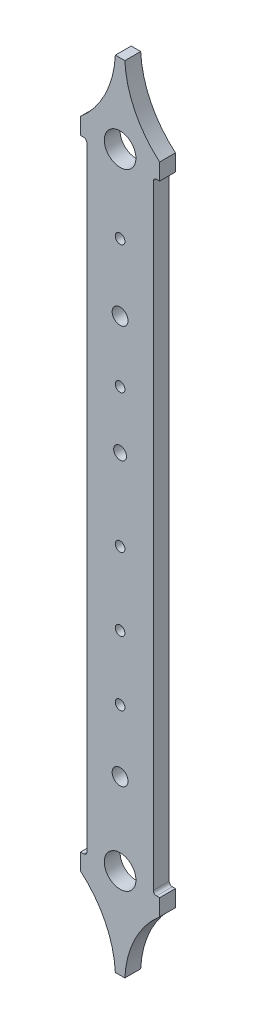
ISO-10303-21;
HEADER;
FILE_DESCRIPTION(('STEP AP214'),'2;1');
FILE_NAME('part.step','',(''),(''),'','','');
FILE_SCHEMA(('AUTOMOTIVE_DESIGN { 1 0 10303 214 1 1 1 1 }'));
ENDSEC;
DATA;
#1=APPLICATION_CONTEXT('core data for automotive mechanical design processes');
#2=APPLICATION_PROTOCOL_DEFINITION('international standard','automotive_design',2000,#1);
#3=PRODUCT_CONTEXT('',#1,'mechanical');
#4=PRODUCT('Part','Part','',(#3));
#5=PRODUCT_RELATED_PRODUCT_CATEGORY('part','',(#4));
#6=PRODUCT_DEFINITION_FORMATION('','',#4);
#7=PRODUCT_DEFINITION_CONTEXT('part definition',#1,'design');
#8=PRODUCT_DEFINITION('design','',#6,#7);
#9=PRODUCT_DEFINITION_SHAPE('','',#8);
#10=(LENGTH_UNIT() NAMED_UNIT(*) SI_UNIT(.MILLI.,.METRE.));
#11=(NAMED_UNIT(*) PLANE_ANGLE_UNIT() SI_UNIT($,.RADIAN.));
#12=(NAMED_UNIT(*) SI_UNIT($,.STERADIAN.) SOLID_ANGLE_UNIT());
#13=UNCERTAINTY_MEASURE_WITH_UNIT(LENGTH_MEASURE(1.E-05),#10,'distance_accuracy_value','');
#14=(GEOMETRIC_REPRESENTATION_CONTEXT(3) GLOBAL_UNCERTAINTY_ASSIGNED_CONTEXT((#13)) GLOBAL_UNIT_ASSIGNED_CONTEXT((#10,
#11,#12)) REPRESENTATION_CONTEXT('',''));
#15=CARTESIAN_POINT('',(0.,0.,0.));
#16=DIRECTION('',(0.,0.,1.));
#17=DIRECTION('',(1.,0.,0.));
#18=AXIS2_PLACEMENT_3D('',#15,#16,#17);
#19=CARTESIAN_POINT('',(20.9999999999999,-196.063687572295,10.));
#20=DIRECTION('',(-1.,0.,0.));
#21=DIRECTION('',(0.,-1.,0.));
#22=AXIS2_PLACEMENT_3D('',#19,#20,#21);
#23=PLANE('',#22);
#24=DIRECTION('',(0.,1.,0.));
#25=VECTOR('',#24,1.);
#26=CARTESIAN_POINT('',(20.9999999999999,-196.063687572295,10.));
#27=LINE('',#26,#25);
#28=CARTESIAN_POINT('',(20.9999999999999,-194.063687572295,10.));
#29=VERTEX_POINT('',#28);
#30=CARTESIAN_POINT('',(21.,194.063687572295,10.));
#31=VERTEX_POINT('',#30);
#32=EDGE_CURVE('E175',#29,#31,#27,.T.);
#33=ORIENTED_EDGE('',*,*,#32,.F.);
#34=DIRECTION('',(0.,0.,-1.));
#35=VECTOR('',#34,1.);
#36=CARTESIAN_POINT('',(20.9999999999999,-194.063687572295,0.));
#37=LINE('',#36,#35);
#38=CARTESIAN_POINT('',(20.9999999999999,-194.063687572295,0.));
#39=VERTEX_POINT('',#38);
#40=EDGE_CURVE('E289',#29,#39,#37,.T.);
#41=ORIENTED_EDGE('',*,*,#40,.T.);
#42=DIRECTION('',(0.,1.,0.));
#43=VECTOR('',#42,1.);
#44=CARTESIAN_POINT('',(20.9999999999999,-196.063687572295,0.));
#45=LINE('',#44,#43);
#46=CARTESIAN_POINT('',(21.,194.063687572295,0.));
#47=VERTEX_POINT('',#46);
#48=EDGE_CURVE('E222',#39,#47,#45,.T.);
#49=ORIENTED_EDGE('',*,*,#48,.T.);
#50=DIRECTION('',(0.,0.,-1.));
#51=VECTOR('',#50,1.);
#52=CARTESIAN_POINT('',(21.,194.063687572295,10.));
#53=LINE('',#52,#51);
#54=EDGE_CURVE('E184',#47,#31,#53,.F.);
#55=ORIENTED_EDGE('',*,*,#54,.T.);
#56=EDGE_LOOP('',(#33,#41,#49,#55));
#57=FACE_BOUND('',#56,.T.);
#58=ADVANCED_FACE('F32',(#57),#23,.F.);
#59=CARTESIAN_POINT('',(25.,196.063687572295,10.));
#60=DIRECTION('',(0.,1.,0.));
#61=DIRECTION('',(-1.,0.,0.));
#62=AXIS2_PLACEMENT_3D('',#59,#60,#61);
#63=PLANE('',#62);
#64=DIRECTION('',(1.,0.,0.));
#65=VECTOR('',#64,1.);
#66=CARTESIAN_POINT('',(25.,196.063687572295,10.));
#67=LINE('',#66,#65);
#68=CARTESIAN_POINT('',(23.,196.063687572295,10.));
#69=VERTEX_POINT('',#68);
#70=CARTESIAN_POINT('',(25.,196.063687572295,10.));
#71=VERTEX_POINT('',#70);
#72=EDGE_CURVE('E167',#69,#71,#67,.T.);
#73=ORIENTED_EDGE('',*,*,#72,.F.);
#74=DIRECTION('',(0.,0.,-1.));
#75=VECTOR('',#74,1.);
#76=CARTESIAN_POINT('',(23.,196.063687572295,0.));
#77=LINE('',#76,#75);
#78=CARTESIAN_POINT('',(23.,196.063687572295,0.));
#79=VERTEX_POINT('',#78);
#80=EDGE_CURVE('E304',#69,#79,#77,.T.);
#81=ORIENTED_EDGE('',*,*,#80,.T.);
#82=DIRECTION('',(1.,0.,0.));
#83=VECTOR('',#82,1.);
#84=CARTESIAN_POINT('',(25.,196.063687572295,0.));
#85=LINE('',#84,#83);
#86=CARTESIAN_POINT('',(25.,196.063687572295,0.));
#87=VERTEX_POINT('',#86);
#88=EDGE_CURVE('E181',#79,#87,#85,.T.);
#89=ORIENTED_EDGE('',*,*,#88,.T.);
#90=DIRECTION('',(0.,0.,-1.));
#91=VECTOR('',#90,1.);
#92=CARTESIAN_POINT('',(25.,196.063687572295,10.));
#93=LINE('',#92,#91);
#94=EDGE_CURVE('E178',#71,#87,#93,.T.);
#95=ORIENTED_EDGE('',*,*,#94,.F.);
#96=EDGE_LOOP('',(#73,#81,#89,#95));
#97=FACE_BOUND('',#96,.T.);
#98=ADVANCED_FACE('F179',(#97),#63,.F.);
#99=CARTESIAN_POINT('',(25.,196.063687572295,10.));
#100=DIRECTION('',(-1.,0.,0.));
#101=DIRECTION('',(0.,0.,1.));
#102=AXIS2_PLACEMENT_3D('',#99,#100,#101);
#103=PLANE('',#102);
#104=DIRECTION('',(0.,1.,0.));
#105=VECTOR('',#104,1.);
#106=CARTESIAN_POINT('',(25.,196.063687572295,0.));
#107=LINE('',#106,#105);
#108=CARTESIAN_POINT('',(25.,206.533687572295,0.));
#109=VERTEX_POINT('',#108);
#110=EDGE_CURVE('E227',#87,#109,#107,.T.);
#111=ORIENTED_EDGE('',*,*,#110,.T.);
#112=DIRECTION('',(0.,0.,-1.));
#113=VECTOR('',#112,1.);
#114=CARTESIAN_POINT('',(25.,206.533687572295,10.));
#115=LINE('',#114,#113);
#116=CARTESIAN_POINT('',(25.,206.533687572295,10.));
#117=VERTEX_POINT('',#116);
#118=EDGE_CURVE('E185',#117,#109,#115,.T.);
#119=ORIENTED_EDGE('',*,*,#118,.F.);
#120=DIRECTION('',(0.,1.,0.));
#121=VECTOR('',#120,1.);
#122=CARTESIAN_POINT('',(25.,196.063687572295,10.));
#123=LINE('',#122,#121);
#124=EDGE_CURVE('E172',#71,#117,#123,.T.);
#125=ORIENTED_EDGE('',*,*,#124,.F.);
#126=ORIENTED_EDGE('',*,*,#94,.T.);
#127=EDGE_LOOP('',(#111,#119,#125,#126));
#128=FACE_BOUND('',#127,.T.);
#129=ADVANCED_FACE('F187',(#128),#103,.F.);
#130=CARTESIAN_POINT('',(65.4177134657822,254.206095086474,10.));
#131=DIRECTION('',(0.,0.,-1.));
#132=DIRECTION('',(-1.,0.,0.));
#133=AXIS2_PLACEMENT_3D('',#130,#131,#132);
#134=CYLINDRICAL_SURFACE('',#133,62.5);
#135=CARTESIAN_POINT('',(65.4177134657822,254.206095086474,0.));
#136=DIRECTION('',(0.,0.,-1.));
#137=DIRECTION('',(1.,0.,0.));
#138=AXIS2_PLACEMENT_3D('',#135,#136,#137);
#139=CIRCLE('',#138,62.5);
#140=CARTESIAN_POINT('',(2.99999999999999,251.,0.));
#141=VERTEX_POINT('',#140);
#142=EDGE_CURVE('E229',#109,#141,#139,.T.);
#143=ORIENTED_EDGE('',*,*,#142,.T.);
#144=DIRECTION('',(0.,0.,-1.));
#145=VECTOR('',#144,1.);
#146=CARTESIAN_POINT('',(2.99999999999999,251.,10.));
#147=LINE('',#146,#145);
#148=CARTESIAN_POINT('',(2.99999999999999,251.,10.));
#149=VERTEX_POINT('',#148);
#150=EDGE_CURVE('E284',#149,#141,#147,.T.);
#151=ORIENTED_EDGE('',*,*,#150,.F.);
#152=CARTESIAN_POINT('',(65.4177134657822,254.206095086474,10.));
#153=DIRECTION('',(0.,0.,-1.));
#154=DIRECTION('',(1.,0.,0.));
#155=AXIS2_PLACEMENT_3D('',#152,#153,#154);
#156=CIRCLE('',#155,62.5);
#157=EDGE_CURVE('E190',#117,#149,#156,.T.);
#158=ORIENTED_EDGE('',*,*,#157,.F.);
#159=ORIENTED_EDGE('',*,*,#118,.T.);
#160=EDGE_LOOP('',(#143,#151,#158,#159));
#161=FACE_BOUND('',#160,.T.);
#162=ADVANCED_FACE('F387',(#161),#134,.F.);
#163=CARTESIAN_POINT('',(2.99999999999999,251.,10.));
#164=DIRECTION('',(0.,-1.,0.));
#165=DIRECTION('',(0.,0.,-1.));
#166=AXIS2_PLACEMENT_3D('',#163,#164,#165);
#167=PLANE('',#166);
#168=DIRECTION('',(-1.,0.,0.));
#169=VECTOR('',#168,1.);
#170=CARTESIAN_POINT('',(2.99999999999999,251.,0.));
#171=LINE('',#170,#169);
#172=CARTESIAN_POINT('',(-3.00000000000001,251.,0.));
#173=VERTEX_POINT('',#172);
#174=EDGE_CURVE('E231',#141,#173,#171,.T.);
#175=ORIENTED_EDGE('',*,*,#174,.T.);
#176=DIRECTION('',(0.,0.,-1.));
#177=VECTOR('',#176,1.);
#178=CARTESIAN_POINT('',(-3.00000000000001,251.,10.));
#179=LINE('',#178,#177);
#180=CARTESIAN_POINT('',(-3.00000000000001,251.,10.));
#181=VERTEX_POINT('',#180);
#182=EDGE_CURVE('E281',#181,#173,#179,.T.);
#183=ORIENTED_EDGE('',*,*,#182,.F.);
#184=DIRECTION('',(-1.,0.,0.));
#185=VECTOR('',#184,1.);
#186=CARTESIAN_POINT('',(2.99999999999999,251.,10.));
#187=LINE('',#186,#185);
#188=EDGE_CURVE('E192',#149,#181,#187,.T.);
#189=ORIENTED_EDGE('',*,*,#188,.F.);
#190=ORIENTED_EDGE('',*,*,#150,.T.);
#191=EDGE_LOOP('',(#175,#183,#189,#190));
#192=FACE_BOUND('',#191,.T.);
#193=ADVANCED_FACE('F394',(#192),#167,.F.);
#194=CARTESIAN_POINT('',(-65.4177134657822,254.206095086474,10.));
#195=DIRECTION('',(0.,0.,-1.));
#196=DIRECTION('',(-1.,0.,0.));
#197=AXIS2_PLACEMENT_3D('',#194,#195,#196);
#198=CYLINDRICAL_SURFACE('',#197,62.5);
#199=CARTESIAN_POINT('',(-65.4177134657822,254.206095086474,0.));
#200=DIRECTION('',(0.,0.,-1.));
#201=DIRECTION('',(-1.,0.,0.));
#202=AXIS2_PLACEMENT_3D('',#199,#200,#201);
#203=CIRCLE('',#202,62.5);
#204=CARTESIAN_POINT('',(-25.,206.533687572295,0.));
#205=VERTEX_POINT('',#204);
#206=EDGE_CURVE('E233',#173,#205,#203,.T.);
#207=ORIENTED_EDGE('',*,*,#206,.T.);
#208=DIRECTION('',(0.,0.,-1.));
#209=VECTOR('',#208,1.);
#210=CARTESIAN_POINT('',(-25.,206.533687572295,10.));
#211=LINE('',#210,#209);
#212=CARTESIAN_POINT('',(-25.,206.533687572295,10.));
#213=VERTEX_POINT('',#212);
#214=EDGE_CURVE('E278',#213,#205,#211,.T.);
#215=ORIENTED_EDGE('',*,*,#214,.F.);
#216=CARTESIAN_POINT('',(-65.4177134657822,254.206095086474,10.));
#217=DIRECTION('',(0.,0.,-1.));
#218=DIRECTION('',(-1.,0.,0.));
#219=AXIS2_PLACEMENT_3D('',#216,#217,#218);
#220=CIRCLE('',#219,62.5);
#221=EDGE_CURVE('E197',#181,#213,#220,.T.);
#222=ORIENTED_EDGE('',*,*,#221,.F.);
#223=ORIENTED_EDGE('',*,*,#182,.T.);
#224=EDGE_LOOP('',(#207,#215,#222,#223));
#225=FACE_BOUND('',#224,.T.);
#226=ADVANCED_FACE('F397',(#225),#198,.F.);
#227=CARTESIAN_POINT('',(-25.,196.063687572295,10.));
#228=DIRECTION('',(1.,0.,0.));
#229=DIRECTION('',(0.,0.,-1.));
#230=AXIS2_PLACEMENT_3D('',#227,#228,#229);
#231=PLANE('',#230);
#232=DIRECTION('',(0.,-1.,0.));
#233=VECTOR('',#232,1.);
#234=CARTESIAN_POINT('',(-25.,196.063687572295,0.));
#235=LINE('',#234,#233);
#236=CARTESIAN_POINT('',(-25.,196.063687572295,0.));
#237=VERTEX_POINT('',#236);
#238=EDGE_CURVE('E235',#205,#237,#235,.T.);
#239=ORIENTED_EDGE('',*,*,#238,.T.);
#240=DIRECTION('',(0.,0.,-1.));
#241=VECTOR('',#240,1.);
#242=CARTESIAN_POINT('',(-25.,196.063687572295,10.));
#243=LINE('',#242,#241);
#244=CARTESIAN_POINT('',(-25.,196.063687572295,10.));
#245=VERTEX_POINT('',#244);
#246=EDGE_CURVE('E275',#245,#237,#243,.T.);
#247=ORIENTED_EDGE('',*,*,#246,.F.);
#248=DIRECTION('',(0.,-1.,0.));
#249=VECTOR('',#248,1.);
#250=CARTESIAN_POINT('',(-25.,196.063687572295,10.));
#251=LINE('',#250,#249);
#252=EDGE_CURVE('E199',#213,#245,#251,.T.);
#253=ORIENTED_EDGE('',*,*,#252,.F.);
#254=ORIENTED_EDGE('',*,*,#214,.T.);
#255=EDGE_LOOP('',(#239,#247,#253,#254));
#256=FACE_BOUND('',#255,.T.);
#257=ADVANCED_FACE('F402',(#256),#231,.F.);
#258=CARTESIAN_POINT('',(-21.,196.063687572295,10.));
#259=DIRECTION('',(0.,1.,0.));
#260=DIRECTION('',(-1.,0.,0.));
#261=AXIS2_PLACEMENT_3D('',#258,#259,#260);
#262=PLANE('',#261);
#263=DIRECTION('',(1.,0.,0.));
#264=VECTOR('',#263,1.);
#265=CARTESIAN_POINT('',(-21.,196.063687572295,0.));
#266=LINE('',#265,#264);
#267=CARTESIAN_POINT('',(-23.,196.063687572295,0.));
#268=VERTEX_POINT('',#267);
#269=EDGE_CURVE('E237',#237,#268,#266,.T.);
#270=ORIENTED_EDGE('',*,*,#269,.T.);
#271=DIRECTION('',(0.,0.,-1.));
#272=VECTOR('',#271,1.);
#273=CARTESIAN_POINT('',(-23.,196.063687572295,10.));
#274=LINE('',#273,#272);
#275=CARTESIAN_POINT('',(-23.,196.063687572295,10.));
#276=VERTEX_POINT('',#275);
#277=EDGE_CURVE('E302',#268,#276,#274,.F.);
#278=ORIENTED_EDGE('',*,*,#277,.T.);
#279=DIRECTION('',(1.,0.,0.));
#280=VECTOR('',#279,1.);
#281=CARTESIAN_POINT('',(-21.,196.063687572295,10.));
#282=LINE('',#281,#280);
#283=EDGE_CURVE('E201',#245,#276,#282,.T.);
#284=ORIENTED_EDGE('',*,*,#283,.F.);
#285=ORIENTED_EDGE('',*,*,#246,.T.);
#286=EDGE_LOOP('',(#270,#278,#284,#285));
#287=FACE_BOUND('',#286,.T.);
#288=ADVANCED_FACE('F510',(#287),#262,.F.);
#289=CARTESIAN_POINT('',(-21.,-196.063687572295,10.));
#290=DIRECTION('',(1.,0.,0.));
#291=DIRECTION('',(0.,1.,0.));
#292=AXIS2_PLACEMENT_3D('',#289,#290,#291);
#293=PLANE('',#292);
#294=DIRECTION('',(0.,-1.,0.));
#295=VECTOR('',#294,1.);
#296=CARTESIAN_POINT('',(-21.,-196.063687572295,0.));
#297=LINE('',#296,#295);
#298=CARTESIAN_POINT('',(-21.,194.063687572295,0.));
#299=VERTEX_POINT('',#298);
#300=CARTESIAN_POINT('',(-21.,-194.063687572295,0.));
#301=VERTEX_POINT('',#300);
#302=EDGE_CURVE('E240',#299,#301,#297,.T.);
#303=ORIENTED_EDGE('',*,*,#302,.T.);
#304=DIRECTION('',(0.,0.,-1.));
#305=VECTOR('',#304,1.);
#306=CARTESIAN_POINT('',(-21.,-194.063687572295,10.));
#307=LINE('',#306,#305);
#308=CARTESIAN_POINT('',(-21.,-194.063687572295,10.));
#309=VERTEX_POINT('',#308);
#310=EDGE_CURVE('E300',#301,#309,#307,.F.);
#311=ORIENTED_EDGE('',*,*,#310,.T.);
#312=DIRECTION('',(0.,-1.,0.));
#313=VECTOR('',#312,1.);
#314=CARTESIAN_POINT('',(-21.,-196.063687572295,10.));
#315=LINE('',#314,#313);
#316=CARTESIAN_POINT('',(-21.,194.063687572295,10.));
#317=VERTEX_POINT('',#316);
#318=EDGE_CURVE('E204',#317,#309,#315,.T.);
#319=ORIENTED_EDGE('',*,*,#318,.F.);
#320=DIRECTION('',(0.,0.,-1.));
#321=VECTOR('',#320,1.);
#322=CARTESIAN_POINT('',(-21.,194.063687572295,0.));
#323=LINE('',#322,#321);
#324=EDGE_CURVE('E297',#317,#299,#323,.T.);
#325=ORIENTED_EDGE('',*,*,#324,.T.);
#326=EDGE_LOOP('',(#303,#311,#319,#325));
#327=FACE_BOUND('',#326,.T.);
#328=ADVANCED_FACE('F413',(#327),#293,.F.);
#329=CARTESIAN_POINT('',(-21.,-196.063687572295,10.));
#330=DIRECTION('',(0.,-1.,0.));
#331=DIRECTION('',(1.,0.,0.));
#332=AXIS2_PLACEMENT_3D('',#329,#330,#331);
#333=PLANE('',#332);
#334=DIRECTION('',(-1.,0.,0.));
#335=VECTOR('',#334,1.);
#336=CARTESIAN_POINT('',(-21.,-196.063687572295,10.));
#337=LINE('',#336,#335);
#338=CARTESIAN_POINT('',(-23.,-196.063687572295,10.));
#339=VERTEX_POINT('',#338);
#340=CARTESIAN_POINT('',(-25.,-196.063687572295,10.));
#341=VERTEX_POINT('',#340);
#342=EDGE_CURVE('E207',#339,#341,#337,.T.);
#343=ORIENTED_EDGE('',*,*,#342,.F.);
#344=DIRECTION('',(0.,0.,-1.));
#345=VECTOR('',#344,1.);
#346=CARTESIAN_POINT('',(-23.,-196.063687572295,0.));
#347=LINE('',#346,#345);
#348=CARTESIAN_POINT('',(-23.,-196.063687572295,0.));
#349=VERTEX_POINT('',#348);
#350=EDGE_CURVE('E294',#339,#349,#347,.T.);
#351=ORIENTED_EDGE('',*,*,#350,.T.);
#352=DIRECTION('',(-1.,0.,0.));
#353=VECTOR('',#352,1.);
#354=CARTESIAN_POINT('',(-21.,-196.063687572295,0.));
#355=LINE('',#354,#353);
#356=CARTESIAN_POINT('',(-25.,-196.063687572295,0.));
#357=VERTEX_POINT('',#356);
#358=EDGE_CURVE('E243',#349,#357,#355,.T.);
#359=ORIENTED_EDGE('',*,*,#358,.T.);
#360=DIRECTION('',(0.,0.,-1.));
#361=VECTOR('',#360,1.);
#362=CARTESIAN_POINT('',(-25.,-196.063687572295,10.));
#363=LINE('',#362,#361);
#364=EDGE_CURVE('E272',#341,#357,#363,.T.);
#365=ORIENTED_EDGE('',*,*,#364,.F.);
#366=EDGE_LOOP('',(#343,#351,#359,#365));
#367=FACE_BOUND('',#366,.T.);
#368=ADVANCED_FACE('F424',(#367),#333,.F.);
#369=CARTESIAN_POINT('',(-25.,-196.063687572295,10.));
#370=DIRECTION('',(1.,0.,0.));
#371=DIRECTION('',(0.,0.,-1.));
#372=AXIS2_PLACEMENT_3D('',#369,#370,#371);
#373=PLANE('',#372);
#374=DIRECTION('',(0.,-1.,0.));
#375=VECTOR('',#374,1.);
#376=CARTESIAN_POINT('',(-25.,-196.063687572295,0.));
#377=LINE('',#376,#375);
#378=CARTESIAN_POINT('',(-25.,-206.533687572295,0.));
#379=VERTEX_POINT('',#378);
#380=EDGE_CURVE('E245',#357,#379,#377,.T.);
#381=ORIENTED_EDGE('',*,*,#380,.T.);
#382=DIRECTION('',(0.,0.,-1.));
#383=VECTOR('',#382,1.);
#384=CARTESIAN_POINT('',(-25.,-206.533687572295,10.));
#385=LINE('',#384,#383);
#386=CARTESIAN_POINT('',(-25.,-206.533687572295,10.));
#387=VERTEX_POINT('',#386);
#388=EDGE_CURVE('E269',#387,#379,#385,.T.);
#389=ORIENTED_EDGE('',*,*,#388,.F.);
#390=DIRECTION('',(0.,-1.,0.));
#391=VECTOR('',#390,1.);
#392=CARTESIAN_POINT('',(-25.,-196.063687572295,10.));
#393=LINE('',#392,#391);
#394=EDGE_CURVE('E209',#341,#387,#393,.T.);
#395=ORIENTED_EDGE('',*,*,#394,.F.);
#396=ORIENTED_EDGE('',*,*,#364,.T.);
#397=EDGE_LOOP('',(#381,#389,#395,#396));
#398=FACE_BOUND('',#397,.T.);
#399=ADVANCED_FACE('F431',(#398),#373,.F.);
#400=CARTESIAN_POINT('',(-65.4177134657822,-254.206095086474,10.));
#401=DIRECTION('',(0.,0.,-1.));
#402=DIRECTION('',(-1.,0.,0.));
#403=AXIS2_PLACEMENT_3D('',#400,#401,#402);
#404=CYLINDRICAL_SURFACE('',#403,62.5);
#405=CARTESIAN_POINT('',(-65.4177134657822,-254.206095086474,0.));
#406=DIRECTION('',(0.,0.,-1.));
#407=DIRECTION('',(1.,0.,0.));
#408=AXIS2_PLACEMENT_3D('',#405,#406,#407);
#409=CIRCLE('',#408,62.5);
#410=CARTESIAN_POINT('',(-3.00000000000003,-251.,0.));
#411=VERTEX_POINT('',#410);
#412=EDGE_CURVE('E247',#379,#411,#409,.T.);
#413=ORIENTED_EDGE('',*,*,#412,.T.);
#414=DIRECTION('',(0.,0.,-1.));
#415=VECTOR('',#414,1.);
#416=CARTESIAN_POINT('',(-3.00000000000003,-251.,10.));
#417=LINE('',#416,#415);
#418=CARTESIAN_POINT('',(-3.00000000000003,-251.,10.));
#419=VERTEX_POINT('',#418);
#420=EDGE_CURVE('E266',#419,#411,#417,.T.);
#421=ORIENTED_EDGE('',*,*,#420,.F.);
#422=CARTESIAN_POINT('',(-65.4177134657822,-254.206095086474,10.));
#423=DIRECTION('',(0.,0.,-1.));
#424=DIRECTION('',(1.,0.,0.));
#425=AXIS2_PLACEMENT_3D('',#422,#423,#424);
#426=CIRCLE('',#425,62.5);
#427=EDGE_CURVE('E211',#387,#419,#426,.T.);
#428=ORIENTED_EDGE('',*,*,#427,.F.);
#429=ORIENTED_EDGE('',*,*,#388,.T.);
#430=EDGE_LOOP('',(#413,#421,#428,#429));
#431=FACE_BOUND('',#430,.T.);
#432=ADVANCED_FACE('F434',(#431),#404,.F.);
#433=CARTESIAN_POINT('',(2.99999999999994,-251.,10.));
#434=DIRECTION('',(0.,1.,0.));
#435=DIRECTION('',(0.,0.,1.));
#436=AXIS2_PLACEMENT_3D('',#433,#434,#435);
#437=PLANE('',#436);
#438=DIRECTION('',(1.,0.,0.));
#439=VECTOR('',#438,1.);
#440=CARTESIAN_POINT('',(2.99999999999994,-251.,0.));
#441=LINE('',#440,#439);
#442=CARTESIAN_POINT('',(2.99999999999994,-251.,0.));
#443=VERTEX_POINT('',#442);
#444=EDGE_CURVE('E249',#411,#443,#441,.T.);
#445=ORIENTED_EDGE('',*,*,#444,.T.);
#446=DIRECTION('',(0.,0.,-1.));
#447=VECTOR('',#446,1.);
#448=CARTESIAN_POINT('',(2.99999999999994,-251.,10.));
#449=LINE('',#448,#447);
#450=CARTESIAN_POINT('',(2.99999999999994,-251.,10.));
#451=VERTEX_POINT('',#450);
#452=EDGE_CURVE('E263',#451,#443,#449,.T.);
#453=ORIENTED_EDGE('',*,*,#452,.F.);
#454=DIRECTION('',(1.,0.,0.));
#455=VECTOR('',#454,1.);
#456=CARTESIAN_POINT('',(2.99999999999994,-251.,10.));
#457=LINE('',#456,#455);
#458=EDGE_CURVE('E213',#419,#451,#457,.T.);
#459=ORIENTED_EDGE('',*,*,#458,.F.);
#460=ORIENTED_EDGE('',*,*,#420,.T.);
#461=EDGE_LOOP('',(#445,#453,#459,#460));
#462=FACE_BOUND('',#461,.T.);
#463=ADVANCED_FACE('F439',(#462),#437,.F.);
#464=CARTESIAN_POINT('',(65.4177134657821,-254.206095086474,10.));
#465=DIRECTION('',(0.,0.,-1.));
#466=DIRECTION('',(-1.,0.,0.));
#467=AXIS2_PLACEMENT_3D('',#464,#465,#466);
#468=CYLINDRICAL_SURFACE('',#467,62.5);
#469=CARTESIAN_POINT('',(65.4177134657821,-254.206095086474,0.));
#470=DIRECTION('',(0.,0.,-1.));
#471=DIRECTION('',(-1.,0.,0.));
#472=AXIS2_PLACEMENT_3D('',#469,#470,#471);
#473=CIRCLE('',#472,62.5);
#474=CARTESIAN_POINT('',(25.,-206.533687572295,0.));
#475=VERTEX_POINT('',#474);
#476=EDGE_CURVE('E251',#443,#475,#473,.T.);
#477=ORIENTED_EDGE('',*,*,#476,.T.);
#478=DIRECTION('',(0.,0.,-1.));
#479=VECTOR('',#478,1.);
#480=CARTESIAN_POINT('',(25.,-206.533687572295,10.));
#481=LINE('',#480,#479);
#482=CARTESIAN_POINT('',(25.,-206.533687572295,10.));
#483=VERTEX_POINT('',#482);
#484=EDGE_CURVE('E260',#483,#475,#481,.T.);
#485=ORIENTED_EDGE('',*,*,#484,.F.);
#486=CARTESIAN_POINT('',(65.4177134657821,-254.206095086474,10.));
#487=DIRECTION('',(0.,0.,-1.));
#488=DIRECTION('',(-1.,0.,0.));
#489=AXIS2_PLACEMENT_3D('',#486,#487,#488);
#490=CIRCLE('',#489,62.5);
#491=EDGE_CURVE('E215',#451,#483,#490,.T.);
#492=ORIENTED_EDGE('',*,*,#491,.F.);
#493=ORIENTED_EDGE('',*,*,#452,.T.);
#494=EDGE_LOOP('',(#477,#485,#492,#493));
#495=FACE_BOUND('',#494,.T.);
#496=ADVANCED_FACE('F445',(#495),#468,.F.);
#497=CARTESIAN_POINT('',(24.9999999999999,-196.063687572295,10.));
#498=DIRECTION('',(-1.,0.,0.));
#499=DIRECTION('',(0.,0.,1.));
#500=AXIS2_PLACEMENT_3D('',#497,#498,#499);
#501=PLANE('',#500);
#502=DIRECTION('',(0.,1.,0.));
#503=VECTOR('',#502,1.);
#504=CARTESIAN_POINT('',(24.9999999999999,-196.063687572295,0.));
#505=LINE('',#504,#503);
#506=CARTESIAN_POINT('',(24.9999999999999,-196.063687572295,0.));
#507=VERTEX_POINT('',#506);
#508=EDGE_CURVE('E253',#475,#507,#505,.T.);
#509=ORIENTED_EDGE('',*,*,#508,.T.);
#510=DIRECTION('',(0.,0.,-1.));
#511=VECTOR('',#510,1.);
#512=CARTESIAN_POINT('',(24.9999999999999,-196.063687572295,10.));
#513=LINE('',#512,#511);
#514=CARTESIAN_POINT('',(24.9999999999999,-196.063687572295,10.));
#515=VERTEX_POINT('',#514);
#516=EDGE_CURVE('E221',#515,#507,#513,.T.);
#517=ORIENTED_EDGE('',*,*,#516,.F.);
#518=DIRECTION('',(0.,1.,0.));
#519=VECTOR('',#518,1.);
#520=CARTESIAN_POINT('',(24.9999999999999,-196.063687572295,10.));
#521=LINE('',#520,#519);
#522=EDGE_CURVE('E217',#483,#515,#521,.T.);
#523=ORIENTED_EDGE('',*,*,#522,.F.);
#524=ORIENTED_EDGE('',*,*,#484,.T.);
#525=EDGE_LOOP('',(#509,#517,#523,#524));
#526=FACE_BOUND('',#525,.T.);
#527=ADVANCED_FACE('F449',(#526),#501,.F.);
#528=CARTESIAN_POINT('',(24.9999999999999,-196.063687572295,10.));
#529=DIRECTION('',(0.,-1.,0.));
#530=DIRECTION('',(1.,0.,0.));
#531=AXIS2_PLACEMENT_3D('',#528,#529,#530);
#532=PLANE('',#531);
#533=DIRECTION('',(-1.,0.,0.));
#534=VECTOR('',#533,1.);
#535=CARTESIAN_POINT('',(24.9999999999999,-196.063687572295,0.));
#536=LINE('',#535,#534);
#537=CARTESIAN_POINT('',(22.9999999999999,-196.063687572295,0.));
#538=VERTEX_POINT('',#537);
#539=EDGE_CURVE('E255',#507,#538,#536,.T.);
#540=ORIENTED_EDGE('',*,*,#539,.T.);
#541=DIRECTION('',(0.,0.,-1.));
#542=VECTOR('',#541,1.);
#543=CARTESIAN_POINT('',(22.9999999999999,-196.063687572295,10.));
#544=LINE('',#543,#542);
#545=CARTESIAN_POINT('',(22.9999999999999,-196.063687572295,10.));
#546=VERTEX_POINT('',#545);
#547=EDGE_CURVE('E292',#538,#546,#544,.F.);
#548=ORIENTED_EDGE('',*,*,#547,.T.);
#549=DIRECTION('',(-1.,0.,0.));
#550=VECTOR('',#549,1.);
#551=CARTESIAN_POINT('',(24.9999999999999,-196.063687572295,10.));
#552=LINE('',#551,#550);
#553=EDGE_CURVE('E219',#515,#546,#552,.T.);
#554=ORIENTED_EDGE('',*,*,#553,.F.);
#555=ORIENTED_EDGE('',*,*,#516,.T.);
#556=EDGE_LOOP('',(#540,#548,#554,#555));
#557=FACE_BOUND('',#556,.T.);
#558=ADVANCED_FACE('F453',(#557),#532,.F.);
#559=CARTESIAN_POINT('',(65.4177134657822,254.206095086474,10.));
#560=DIRECTION('',(0.,0.,1.));
#561=DIRECTION('',(1.,0.,0.));
#562=AXIS2_PLACEMENT_3D('',#559,#560,#561);
#563=PLANE('',#562);
#564=CARTESIAN_POINT('',(0.,-193.936312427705,10.));
#565=DIRECTION('',(0.,0.,1.));
#566=DIRECTION('',(1.,0.,0.));
#567=AXIS2_PLACEMENT_3D('',#564,#565,#566);
#568=CIRCLE('',#567,10.);
#569=CARTESIAN_POINT('',(10.,-193.936312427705,10.));
#570=VERTEX_POINT('',#569);
#571=EDGE_CURVE('E361',#570,#570,#568,.T.);
#572=ORIENTED_EDGE('',*,*,#571,.F.);
#573=EDGE_LOOP('',(#572));
#574=FACE_BOUND('',#573,.T.);
#575=CARTESIAN_POINT('',(0.,-142.336312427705,10.));
#576=DIRECTION('',(0.,0.,1.));
#577=DIRECTION('',(1.,0.,0.));
#578=AXIS2_PLACEMENT_3D('',#575,#576,#577);
#579=CIRCLE('',#578,5.);
#580=CARTESIAN_POINT('',(5.,-142.336312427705,10.));
#581=VERTEX_POINT('',#580);
#582=EDGE_CURVE('E351',#581,#581,#579,.T.);
#583=ORIENTED_EDGE('',*,*,#582,.F.);
#584=EDGE_LOOP('',(#583));
#585=FACE_BOUND('',#584,.T.);
#586=CARTESIAN_POINT('',(0.,-103.016312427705,10.));
#587=DIRECTION('',(0.,0.,1.));
#588=DIRECTION('',(1.,0.,0.));
#589=AXIS2_PLACEMENT_3D('',#586,#587,#588);
#590=CIRCLE('',#589,3.05);
#591=CARTESIAN_POINT('',(3.05,-103.016312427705,10.));
#592=VERTEX_POINT('',#591);
#593=EDGE_CURVE('E348',#592,#592,#590,.T.);
#594=ORIENTED_EDGE('',*,*,#593,.F.);
#595=EDGE_LOOP('',(#594));
#596=FACE_BOUND('',#595,.T.);
#597=CARTESIAN_POINT('',(0.,-62.3363124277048,10.));
#598=DIRECTION('',(0.,0.,1.));
#599=DIRECTION('',(1.,0.,0.));
#600=AXIS2_PLACEMENT_3D('',#597,#598,#599);
#601=CIRCLE('',#600,3.05);
#602=CARTESIAN_POINT('',(3.05,-62.3363124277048,10.));
#603=VERTEX_POINT('',#602);
#604=EDGE_CURVE('E345',#603,#603,#601,.T.);
#605=ORIENTED_EDGE('',*,*,#604,.F.);
#606=EDGE_LOOP('',(#605));
#607=FACE_BOUND('',#606,.T.);
#608=CARTESIAN_POINT('',(0.,-16.3363124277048,10.));
#609=DIRECTION('',(0.,0.,1.));
#610=DIRECTION('',(1.,0.,0.));
#611=AXIS2_PLACEMENT_3D('',#608,#609,#610);
#612=CIRCLE('',#611,3.05);
#613=CARTESIAN_POINT('',(3.05,-16.3363124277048,10.));
#614=VERTEX_POINT('',#613);
#615=EDGE_CURVE('E341',#614,#614,#612,.T.);
#616=ORIENTED_EDGE('',*,*,#615,.F.);
#617=EDGE_LOOP('',(#616));
#618=FACE_BOUND('',#617,.T.);
#619=CARTESIAN_POINT('',(0.,34.9136875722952,10.));
#620=DIRECTION('',(0.,0.,1.));
#621=DIRECTION('',(1.,0.,0.));
#622=AXIS2_PLACEMENT_3D('',#619,#620,#621);
#623=CIRCLE('',#622,4.05);
#624=CARTESIAN_POINT('',(4.05,34.9136875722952,10.));
#625=VERTEX_POINT('',#624);
#626=EDGE_CURVE('E337',#625,#625,#623,.T.);
#627=ORIENTED_EDGE('',*,*,#626,.F.);
#628=EDGE_LOOP('',(#627));
#629=FACE_BOUND('',#628,.T.);
#630=CARTESIAN_POINT('',(0.,71.0636875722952,10.));
#631=DIRECTION('',(0.,0.,1.));
#632=DIRECTION('',(1.,0.,0.));
#633=AXIS2_PLACEMENT_3D('',#630,#631,#632);
#634=CIRCLE('',#633,3.05);
#635=CARTESIAN_POINT('',(3.05,71.0636875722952,10.));
#636=VERTEX_POINT('',#635);
#637=EDGE_CURVE('E333',#636,#636,#634,.T.);
#638=ORIENTED_EDGE('',*,*,#637,.F.);
#639=EDGE_LOOP('',(#638));
#640=FACE_BOUND('',#639,.T.);
#641=CARTESIAN_POINT('',(0.,109.663687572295,10.));
#642=DIRECTION('',(0.,0.,1.));
#643=DIRECTION('',(1.,0.,0.));
#644=AXIS2_PLACEMENT_3D('',#641,#642,#643);
#645=CIRCLE('',#644,5.);
#646=CARTESIAN_POINT('',(5.,109.663687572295,10.));
#647=VERTEX_POINT('',#646);
#648=EDGE_CURVE('E329',#647,#647,#645,.T.);
#649=ORIENTED_EDGE('',*,*,#648,.F.);
#650=EDGE_LOOP('',(#649));
#651=FACE_BOUND('',#650,.T.);
#652=CARTESIAN_POINT('',(0.,152.063687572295,10.));
#653=DIRECTION('',(0.,0.,1.));
#654=DIRECTION('',(1.,0.,0.));
#655=AXIS2_PLACEMENT_3D('',#652,#653,#654);
#656=CIRCLE('',#655,3.05);
#657=CARTESIAN_POINT('',(3.05,152.063687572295,10.));
#658=VERTEX_POINT('',#657);
#659=EDGE_CURVE('E325',#658,#658,#656,.T.);
#660=ORIENTED_EDGE('',*,*,#659,.F.);
#661=EDGE_LOOP('',(#660));
#662=FACE_BOUND('',#661,.T.);
#663=CARTESIAN_POINT('',(0.,201.063687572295,10.));
#664=DIRECTION('',(0.,0.,1.));
#665=DIRECTION('',(1.,0.,0.));
#666=AXIS2_PLACEMENT_3D('',#663,#664,#665);
#667=CIRCLE('',#666,10.);
#668=CARTESIAN_POINT('',(10.,201.063687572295,10.));
#669=VERTEX_POINT('',#668);
#670=EDGE_CURVE('E321',#669,#669,#667,.T.);
#671=ORIENTED_EDGE('',*,*,#670,.F.);
#672=EDGE_LOOP('',(#671));
#673=FACE_BOUND('',#672,.T.);
#674=ORIENTED_EDGE('',*,*,#553,.T.);
#675=CARTESIAN_POINT('',(22.9999999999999,-194.063687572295,10.));
#676=DIRECTION('',(0.,0.,1.));
#677=DIRECTION('',(1.,0.,0.));
#678=AXIS2_PLACEMENT_3D('',#675,#676,#677);
#679=CIRCLE('',#678,2.);
#680=EDGE_CURVE('E308',#546,#29,#679,.F.);
#681=ORIENTED_EDGE('',*,*,#680,.T.);
#682=ORIENTED_EDGE('',*,*,#32,.T.);
#683=CARTESIAN_POINT('',(23.,194.063687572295,10.));
#684=DIRECTION('',(0.,0.,1.));
#685=DIRECTION('',(1.,0.,0.));
#686=AXIS2_PLACEMENT_3D('',#683,#684,#685);
#687=CIRCLE('',#686,2.);
#688=EDGE_CURVE('E11',#31,#69,#687,.F.);
#689=ORIENTED_EDGE('',*,*,#688,.T.);
#690=ORIENTED_EDGE('',*,*,#72,.T.);
#691=ORIENTED_EDGE('',*,*,#124,.T.);
#692=ORIENTED_EDGE('',*,*,#157,.T.);
#693=ORIENTED_EDGE('',*,*,#188,.T.);
#694=ORIENTED_EDGE('',*,*,#221,.T.);
#695=ORIENTED_EDGE('',*,*,#252,.T.);
#696=ORIENTED_EDGE('',*,*,#283,.T.);
#697=CARTESIAN_POINT('',(-23.,194.063687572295,10.));
#698=DIRECTION('',(0.,0.,1.));
#699=DIRECTION('',(1.,0.,0.));
#700=AXIS2_PLACEMENT_3D('',#697,#698,#699);
#701=CIRCLE('',#700,2.);
#702=EDGE_CURVE('E316',#276,#317,#701,.F.);
#703=ORIENTED_EDGE('',*,*,#702,.T.);
#704=ORIENTED_EDGE('',*,*,#318,.T.);
#705=CARTESIAN_POINT('',(-23.,-194.063687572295,10.));
#706=DIRECTION('',(0.,0.,1.));
#707=DIRECTION('',(1.,0.,0.));
#708=AXIS2_PLACEMENT_3D('',#705,#706,#707);
#709=CIRCLE('',#708,2.);
#710=EDGE_CURVE('E312',#309,#339,#709,.F.);
#711=ORIENTED_EDGE('',*,*,#710,.T.);
#712=ORIENTED_EDGE('',*,*,#342,.T.);
#713=ORIENTED_EDGE('',*,*,#394,.T.);
#714=ORIENTED_EDGE('',*,*,#427,.T.);
#715=ORIENTED_EDGE('',*,*,#458,.T.);
#716=ORIENTED_EDGE('',*,*,#491,.T.);
#717=ORIENTED_EDGE('',*,*,#522,.T.);
#718=EDGE_LOOP('',(#674,#681,#682,#689,#690,#691,#692,#693,#694,#695,#696,#703,#704,#711,#712,
#713,#714,#715,#716,#717));
#719=FACE_BOUND('',#718,.T.);
#720=ADVANCED_FACE('F170',(#574,#585,#596,#607,#618,#629,#640,#651,#662,#673,#719),#563,.T.);
#721=CARTESIAN_POINT('',(65.4177134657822,254.206095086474,0.));
#722=DIRECTION('',(0.,0.,1.));
#723=DIRECTION('',(1.,0.,0.));
#724=AXIS2_PLACEMENT_3D('',#721,#722,#723);
#725=PLANE('',#724);
#726=CARTESIAN_POINT('',(0.,-193.936312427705,0.));
#727=DIRECTION('',(0.,0.,1.));
#728=DIRECTION('',(1.,0.,0.));
#729=AXIS2_PLACEMENT_3D('',#726,#727,#728);
#730=CIRCLE('',#729,10.);
#731=CARTESIAN_POINT('',(10.,-193.936312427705,0.));
#732=VERTEX_POINT('',#731);
#733=EDGE_CURVE('E36',#732,#732,#730,.T.);
#734=ORIENTED_EDGE('',*,*,#733,.T.);
#735=EDGE_LOOP('',(#734));
#736=FACE_BOUND('',#735,.T.);
#737=CARTESIAN_POINT('',(0.,-142.336312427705,0.));
#738=DIRECTION('',(0.,0.,1.));
#739=DIRECTION('',(1.,0.,0.));
#740=AXIS2_PLACEMENT_3D('',#737,#738,#739);
#741=CIRCLE('',#740,5.);
#742=CARTESIAN_POINT('',(5.,-142.336312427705,0.));
#743=VERTEX_POINT('',#742);
#744=EDGE_CURVE('E349',#743,#743,#741,.T.);
#745=ORIENTED_EDGE('',*,*,#744,.T.);
#746=EDGE_LOOP('',(#745));
#747=FACE_BOUND('',#746,.T.);
#748=CARTESIAN_POINT('',(0.,-103.016312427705,0.));
#749=DIRECTION('',(0.,0.,1.));
#750=DIRECTION('',(1.,0.,0.));
#751=AXIS2_PLACEMENT_3D('',#748,#749,#750);
#752=CIRCLE('',#751,3.05);
#753=CARTESIAN_POINT('',(3.05,-103.016312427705,0.));
#754=VERTEX_POINT('',#753);
#755=EDGE_CURVE('E346',#754,#754,#752,.T.);
#756=ORIENTED_EDGE('',*,*,#755,.T.);
#757=EDGE_LOOP('',(#756));
#758=FACE_BOUND('',#757,.T.);
#759=CARTESIAN_POINT('',(0.,-62.3363124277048,0.));
#760=DIRECTION('',(0.,0.,1.));
#761=DIRECTION('',(1.,0.,0.));
#762=AXIS2_PLACEMENT_3D('',#759,#760,#761);
#763=CIRCLE('',#762,3.05);
#764=CARTESIAN_POINT('',(3.05,-62.3363124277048,0.));
#765=VERTEX_POINT('',#764);
#766=EDGE_CURVE('E342',#765,#765,#763,.T.);
#767=ORIENTED_EDGE('',*,*,#766,.T.);
#768=EDGE_LOOP('',(#767));
#769=FACE_BOUND('',#768,.T.);
#770=CARTESIAN_POINT('',(0.,-16.3363124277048,0.));
#771=DIRECTION('',(0.,0.,1.));
#772=DIRECTION('',(1.,0.,0.));
#773=AXIS2_PLACEMENT_3D('',#770,#771,#772);
#774=CIRCLE('',#773,3.05);
#775=CARTESIAN_POINT('',(3.05,-16.3363124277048,0.));
#776=VERTEX_POINT('',#775);
#777=EDGE_CURVE('E338',#776,#776,#774,.T.);
#778=ORIENTED_EDGE('',*,*,#777,.T.);
#779=EDGE_LOOP('',(#778));
#780=FACE_BOUND('',#779,.T.);
#781=CARTESIAN_POINT('',(0.,34.9136875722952,0.));
#782=DIRECTION('',(0.,0.,1.));
#783=DIRECTION('',(1.,0.,0.));
#784=AXIS2_PLACEMENT_3D('',#781,#782,#783);
#785=CIRCLE('',#784,4.05);
#786=CARTESIAN_POINT('',(4.05,34.9136875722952,0.));
#787=VERTEX_POINT('',#786);
#788=EDGE_CURVE('E334',#787,#787,#785,.T.);
#789=ORIENTED_EDGE('',*,*,#788,.T.);
#790=EDGE_LOOP('',(#789));
#791=FACE_BOUND('',#790,.T.);
#792=CARTESIAN_POINT('',(0.,71.0636875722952,0.));
#793=DIRECTION('',(0.,0.,1.));
#794=DIRECTION('',(1.,0.,0.));
#795=AXIS2_PLACEMENT_3D('',#792,#793,#794);
#796=CIRCLE('',#795,3.05);
#797=CARTESIAN_POINT('',(3.05,71.0636875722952,0.));
#798=VERTEX_POINT('',#797);
#799=EDGE_CURVE('E330',#798,#798,#796,.T.);
#800=ORIENTED_EDGE('',*,*,#799,.T.);
#801=EDGE_LOOP('',(#800));
#802=FACE_BOUND('',#801,.T.);
#803=CARTESIAN_POINT('',(0.,109.663687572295,0.));
#804=DIRECTION('',(0.,0.,1.));
#805=DIRECTION('',(1.,0.,0.));
#806=AXIS2_PLACEMENT_3D('',#803,#804,#805);
#807=CIRCLE('',#806,5.);
#808=CARTESIAN_POINT('',(5.,109.663687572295,0.));
#809=VERTEX_POINT('',#808);
#810=EDGE_CURVE('E326',#809,#809,#807,.T.);
#811=ORIENTED_EDGE('',*,*,#810,.T.);
#812=EDGE_LOOP('',(#811));
#813=FACE_BOUND('',#812,.T.);
#814=CARTESIAN_POINT('',(0.,152.063687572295,0.));
#815=DIRECTION('',(0.,0.,1.));
#816=DIRECTION('',(1.,0.,0.));
#817=AXIS2_PLACEMENT_3D('',#814,#815,#816);
#818=CIRCLE('',#817,3.05);
#819=CARTESIAN_POINT('',(3.05,152.063687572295,0.));
#820=VERTEX_POINT('',#819);
#821=EDGE_CURVE('E322',#820,#820,#818,.T.);
#822=ORIENTED_EDGE('',*,*,#821,.T.);
#823=EDGE_LOOP('',(#822));
#824=FACE_BOUND('',#823,.T.);
#825=CARTESIAN_POINT('',(0.,201.063687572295,0.));
#826=DIRECTION('',(0.,0.,1.));
#827=DIRECTION('',(1.,0.,0.));
#828=AXIS2_PLACEMENT_3D('',#825,#826,#827);
#829=CIRCLE('',#828,10.);
#830=CARTESIAN_POINT('',(10.,201.063687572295,0.));
#831=VERTEX_POINT('',#830);
#832=EDGE_CURVE('E225',#831,#831,#829,.T.);
#833=ORIENTED_EDGE('',*,*,#832,.T.);
#834=EDGE_LOOP('',(#833));
#835=FACE_BOUND('',#834,.T.);
#836=ORIENTED_EDGE('',*,*,#48,.F.);
#837=CARTESIAN_POINT('',(22.9999999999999,-194.063687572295,0.));
#838=DIRECTION('',(0.,0.,1.));
#839=DIRECTION('',(1.,0.,0.));
#840=AXIS2_PLACEMENT_3D('',#837,#838,#839);
#841=CIRCLE('',#840,2.);
#842=EDGE_CURVE('E306',#39,#538,#841,.T.);
#843=ORIENTED_EDGE('',*,*,#842,.T.);
#844=ORIENTED_EDGE('',*,*,#539,.F.);
#845=ORIENTED_EDGE('',*,*,#508,.F.);
#846=ORIENTED_EDGE('',*,*,#476,.F.);
#847=ORIENTED_EDGE('',*,*,#444,.F.);
#848=ORIENTED_EDGE('',*,*,#412,.F.);
#849=ORIENTED_EDGE('',*,*,#380,.F.);
#850=ORIENTED_EDGE('',*,*,#358,.F.);
#851=CARTESIAN_POINT('',(-23.,-194.063687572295,0.));
#852=DIRECTION('',(0.,0.,1.));
#853=DIRECTION('',(1.,0.,0.));
#854=AXIS2_PLACEMENT_3D('',#851,#852,#853);
#855=CIRCLE('',#854,2.);
#856=EDGE_CURVE('E310',#349,#301,#855,.T.);
#857=ORIENTED_EDGE('',*,*,#856,.T.);
#858=ORIENTED_EDGE('',*,*,#302,.F.);
#859=CARTESIAN_POINT('',(-23.,194.063687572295,0.));
#860=DIRECTION('',(0.,0.,1.));
#861=DIRECTION('',(1.,0.,0.));
#862=AXIS2_PLACEMENT_3D('',#859,#860,#861);
#863=CIRCLE('',#862,2.);
#864=EDGE_CURVE('E314',#299,#268,#863,.T.);
#865=ORIENTED_EDGE('',*,*,#864,.T.);
#866=ORIENTED_EDGE('',*,*,#269,.F.);
#867=ORIENTED_EDGE('',*,*,#238,.F.);
#868=ORIENTED_EDGE('',*,*,#206,.F.);
#869=ORIENTED_EDGE('',*,*,#174,.F.);
#870=ORIENTED_EDGE('',*,*,#142,.F.);
#871=ORIENTED_EDGE('',*,*,#110,.F.);
#872=ORIENTED_EDGE('',*,*,#88,.F.);
#873=CARTESIAN_POINT('',(23.,194.063687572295,0.));
#874=DIRECTION('',(0.,0.,1.));
#875=DIRECTION('',(1.,0.,0.));
#876=AXIS2_PLACEMENT_3D('',#873,#874,#875);
#877=CIRCLE('',#876,2.);
#878=EDGE_CURVE('E41',#79,#47,#877,.T.);
#879=ORIENTED_EDGE('',*,*,#878,.T.);
#880=EDGE_LOOP('',(#836,#843,#844,#845,#846,#847,#848,#849,#850,#857,#858,#865,#866,#867,#868,
#869,#870,#871,#872,#879));
#881=FACE_BOUND('',#880,.T.);
#882=ADVANCED_FACE('F383',(#736,#747,#758,#769,#780,#791,#802,#813,#824,#835,#881),#725,.F.);
#883=CARTESIAN_POINT('',(22.9999999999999,-194.063687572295,10.));
#884=DIRECTION('',(0.,0.,1.));
#885=DIRECTION('',(1.,0.,0.));
#886=AXIS2_PLACEMENT_3D('',#883,#884,#885);
#887=CYLINDRICAL_SURFACE('',#886,2.);
#888=ORIENTED_EDGE('',*,*,#680,.F.);
#889=ORIENTED_EDGE('',*,*,#547,.F.);
#890=ORIENTED_EDGE('',*,*,#842,.F.);
#891=ORIENTED_EDGE('',*,*,#40,.F.);
#892=EDGE_LOOP('',(#888,#889,#890,#891));
#893=FACE_BOUND('',#892,.T.);
#894=ADVANCED_FACE('F456',(#893),#887,.F.);
#895=CARTESIAN_POINT('',(-23.,-194.063687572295,10.));
#896=DIRECTION('',(0.,0.,1.));
#897=DIRECTION('',(1.,0.,0.));
#898=AXIS2_PLACEMENT_3D('',#895,#896,#897);
#899=CYLINDRICAL_SURFACE('',#898,2.);
#900=ORIENTED_EDGE('',*,*,#710,.F.);
#901=ORIENTED_EDGE('',*,*,#310,.F.);
#902=ORIENTED_EDGE('',*,*,#856,.F.);
#903=ORIENTED_EDGE('',*,*,#350,.F.);
#904=EDGE_LOOP('',(#900,#901,#902,#903));
#905=FACE_BOUND('',#904,.T.);
#906=ADVANCED_FACE('F421',(#905),#899,.F.);
#907=CARTESIAN_POINT('',(-23.,194.063687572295,10.));
#908=DIRECTION('',(0.,0.,1.));
#909=DIRECTION('',(1.,0.,0.));
#910=AXIS2_PLACEMENT_3D('',#907,#908,#909);
#911=CYLINDRICAL_SURFACE('',#910,2.);
#912=ORIENTED_EDGE('',*,*,#702,.F.);
#913=ORIENTED_EDGE('',*,*,#277,.F.);
#914=ORIENTED_EDGE('',*,*,#864,.F.);
#915=ORIENTED_EDGE('',*,*,#324,.F.);
#916=EDGE_LOOP('',(#912,#913,#914,#915));
#917=FACE_BOUND('',#916,.T.);
#918=ADVANCED_FACE('F410',(#917),#911,.F.);
#919=CARTESIAN_POINT('',(23.,194.063687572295,10.));
#920=DIRECTION('',(0.,0.,1.));
#921=DIRECTION('',(1.,0.,0.));
#922=AXIS2_PLACEMENT_3D('',#919,#920,#921);
#923=CYLINDRICAL_SURFACE('',#922,2.);
#924=ORIENTED_EDGE('',*,*,#688,.F.);
#925=ORIENTED_EDGE('',*,*,#54,.F.);
#926=ORIENTED_EDGE('',*,*,#878,.F.);
#927=ORIENTED_EDGE('',*,*,#80,.F.);
#928=EDGE_LOOP('',(#924,#925,#926,#927));
#929=FACE_BOUND('',#928,.T.);
#930=ADVANCED_FACE('F34',(#929),#923,.F.);
#931=CARTESIAN_POINT('',(0.,201.063687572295,-46.));
#932=DIRECTION('',(0.,0.,1.));
#933=DIRECTION('',(1.,0.,0.));
#934=AXIS2_PLACEMENT_3D('',#931,#932,#933);
#935=CYLINDRICAL_SURFACE('',#934,10.);
#936=ORIENTED_EDGE('',*,*,#670,.T.);
#937=EDGE_LOOP('',(#936));
#938=FACE_BOUND('',#937,.T.);
#939=ORIENTED_EDGE('',*,*,#832,.F.);
#940=EDGE_LOOP('',(#939));
#941=FACE_BOUND('',#940,.T.);
#942=ADVANCED_FACE('F472',(#938,#941),#935,.F.);
#943=CARTESIAN_POINT('',(0.,152.063687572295,-46.));
#944=DIRECTION('',(0.,0.,1.));
#945=DIRECTION('',(1.,0.,0.));
#946=AXIS2_PLACEMENT_3D('',#943,#944,#945);
#947=CYLINDRICAL_SURFACE('',#946,3.05);
#948=ORIENTED_EDGE('',*,*,#659,.T.);
#949=EDGE_LOOP('',(#948));
#950=FACE_BOUND('',#949,.T.);
#951=ORIENTED_EDGE('',*,*,#821,.F.);
#952=EDGE_LOOP('',(#951));
#953=FACE_BOUND('',#952,.T.);
#954=ADVANCED_FACE('F476',(#950,#953),#947,.F.);
#955=CARTESIAN_POINT('',(0.,109.663687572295,-46.));
#956=DIRECTION('',(0.,0.,1.));
#957=DIRECTION('',(1.,0.,0.));
#958=AXIS2_PLACEMENT_3D('',#955,#956,#957);
#959=CYLINDRICAL_SURFACE('',#958,5.);
#960=ORIENTED_EDGE('',*,*,#648,.T.);
#961=EDGE_LOOP('',(#960));
#962=FACE_BOUND('',#961,.T.);
#963=ORIENTED_EDGE('',*,*,#810,.F.);
#964=EDGE_LOOP('',(#963));
#965=FACE_BOUND('',#964,.T.);
#966=ADVANCED_FACE('F482',(#962,#965),#959,.F.);
#967=CARTESIAN_POINT('',(0.,71.0636875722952,-46.));
#968=DIRECTION('',(0.,0.,1.));
#969=DIRECTION('',(1.,0.,0.));
#970=AXIS2_PLACEMENT_3D('',#967,#968,#969);
#971=CYLINDRICAL_SURFACE('',#970,3.05);
#972=ORIENTED_EDGE('',*,*,#637,.T.);
#973=EDGE_LOOP('',(#972));
#974=FACE_BOUND('',#973,.T.);
#975=ORIENTED_EDGE('',*,*,#799,.F.);
#976=EDGE_LOOP('',(#975));
#977=FACE_BOUND('',#976,.T.);
#978=ADVANCED_FACE('F620',(#974,#977),#971,.F.);
#979=CARTESIAN_POINT('',(0.,34.9136875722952,-46.));
#980=DIRECTION('',(0.,0.,1.));
#981=DIRECTION('',(1.,0.,0.));
#982=AXIS2_PLACEMENT_3D('',#979,#980,#981);
#983=CYLINDRICAL_SURFACE('',#982,4.05);
#984=ORIENTED_EDGE('',*,*,#626,.T.);
#985=EDGE_LOOP('',(#984));
#986=FACE_BOUND('',#985,.T.);
#987=ORIENTED_EDGE('',*,*,#788,.F.);
#988=EDGE_LOOP('',(#987));
#989=FACE_BOUND('',#988,.T.);
#990=ADVANCED_FACE('F628',(#986,#989),#983,.F.);
#991=CARTESIAN_POINT('',(0.,-16.3363124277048,-46.));
#992=DIRECTION('',(0.,0.,1.));
#993=DIRECTION('',(1.,0.,0.));
#994=AXIS2_PLACEMENT_3D('',#991,#992,#993);
#995=CYLINDRICAL_SURFACE('',#994,3.05);
#996=ORIENTED_EDGE('',*,*,#615,.T.);
#997=EDGE_LOOP('',(#996));
#998=FACE_BOUND('',#997,.T.);
#999=ORIENTED_EDGE('',*,*,#777,.F.);
#1000=EDGE_LOOP('',(#999));
#1001=FACE_BOUND('',#1000,.T.);
#1002=ADVANCED_FACE('F637',(#998,#1001),#995,.F.);
#1003=CARTESIAN_POINT('',(0.,-62.3363124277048,-46.));
#1004=DIRECTION('',(0.,0.,1.));
#1005=DIRECTION('',(1.,0.,0.));
#1006=AXIS2_PLACEMENT_3D('',#1003,#1004,#1005);
#1007=CYLINDRICAL_SURFACE('',#1006,3.05);
#1008=ORIENTED_EDGE('',*,*,#604,.T.);
#1009=EDGE_LOOP('',(#1008));
#1010=FACE_BOUND('',#1009,.T.);
#1011=ORIENTED_EDGE('',*,*,#766,.F.);
#1012=EDGE_LOOP('',(#1011));
#1013=FACE_BOUND('',#1012,.T.);
#1014=ADVANCED_FACE('F646',(#1010,#1013),#1007,.F.);
#1015=CARTESIAN_POINT('',(0.,-103.016312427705,-46.));
#1016=DIRECTION('',(0.,0.,1.));
#1017=DIRECTION('',(1.,0.,0.));
#1018=AXIS2_PLACEMENT_3D('',#1015,#1016,#1017);
#1019=CYLINDRICAL_SURFACE('',#1018,3.05);
#1020=ORIENTED_EDGE('',*,*,#593,.T.);
#1021=EDGE_LOOP('',(#1020));
#1022=FACE_BOUND('',#1021,.T.);
#1023=ORIENTED_EDGE('',*,*,#755,.F.);
#1024=EDGE_LOOP('',(#1023));
#1025=FACE_BOUND('',#1024,.T.);
#1026=ADVANCED_FACE('F655',(#1022,#1025),#1019,.F.);
#1027=CARTESIAN_POINT('',(0.,-142.336312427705,-46.));
#1028=DIRECTION('',(0.,0.,1.));
#1029=DIRECTION('',(1.,0.,0.));
#1030=AXIS2_PLACEMENT_3D('',#1027,#1028,#1029);
#1031=CYLINDRICAL_SURFACE('',#1030,5.);
#1032=ORIENTED_EDGE('',*,*,#582,.T.);
#1033=EDGE_LOOP('',(#1032));
#1034=FACE_BOUND('',#1033,.T.);
#1035=ORIENTED_EDGE('',*,*,#744,.F.);
#1036=EDGE_LOOP('',(#1035));
#1037=FACE_BOUND('',#1036,.T.);
#1038=ADVANCED_FACE('F664',(#1034,#1037),#1031,.F.);
#1039=CARTESIAN_POINT('',(0.,-193.936312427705,-46.));
#1040=DIRECTION('',(0.,0.,1.));
#1041=DIRECTION('',(1.,0.,0.));
#1042=AXIS2_PLACEMENT_3D('',#1039,#1040,#1041);
#1043=CYLINDRICAL_SURFACE('',#1042,10.);
#1044=ORIENTED_EDGE('',*,*,#571,.T.);
#1045=EDGE_LOOP('',(#1044));
#1046=FACE_BOUND('',#1045,.T.);
#1047=ORIENTED_EDGE('',*,*,#733,.F.);
#1048=EDGE_LOOP('',(#1047));
#1049=FACE_BOUND('',#1048,.T.);
#1050=ADVANCED_FACE('F673',(#1046,#1049),#1043,.F.);
#1051=CLOSED_SHELL('',(#58,#98,#129,#162,#193,#226,#257,#288,#328,#368,#399,#432,#463,#496,#527,
#558,#720,#882,#894,#906,#918,#930,#942,#954,#966,#978,#990,#1002,#1014,#1026,#1038,#1050));
#1052=MANIFOLD_SOLID_BREP('B2',#1051);
#1053=ADVANCED_BREP_SHAPE_REPRESENTATION('',(#18,#1052),#14);
#1054=SHAPE_DEFINITION_REPRESENTATION(#9,#1053);
ENDSEC;
END-ISO-10303-21;
